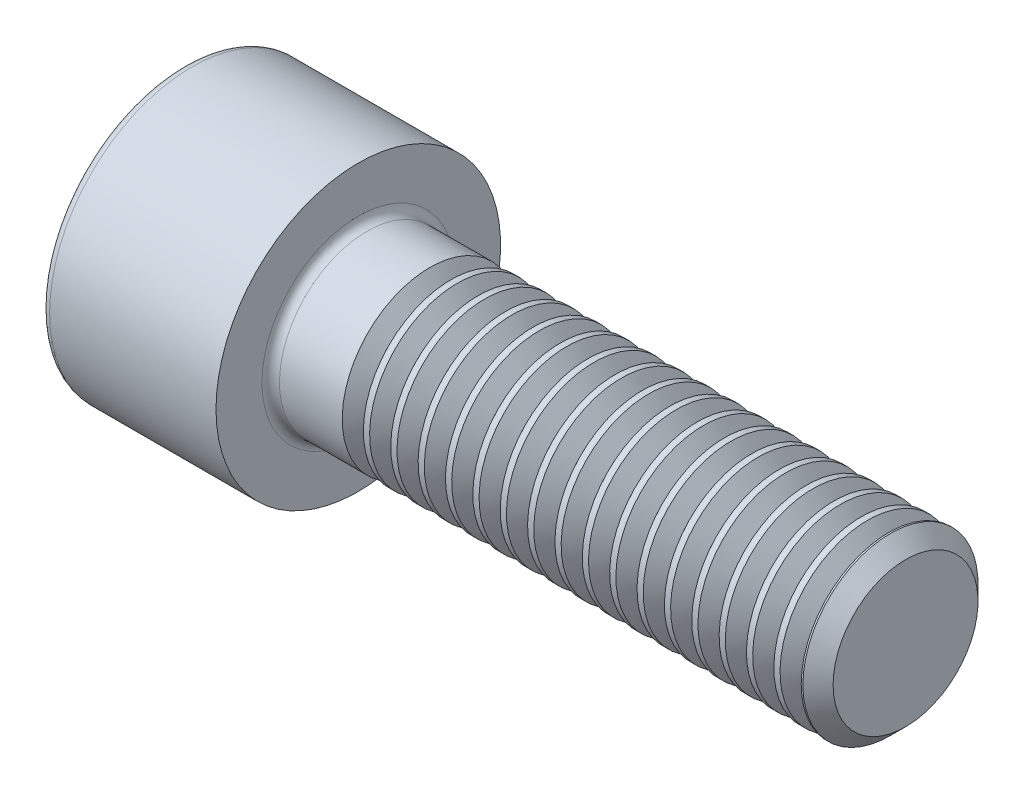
ISO-10303-21;
HEADER;
FILE_DESCRIPTION(('STEP AP214'),'2;1');
FILE_NAME('part.step','',(''),(''),'','','');
FILE_SCHEMA(('AUTOMOTIVE_DESIGN { 1 0 10303 214 1 1 1 1 }'));
ENDSEC;
DATA;
#1=APPLICATION_CONTEXT('core data for automotive mechanical design processes');
#2=APPLICATION_PROTOCOL_DEFINITION('international standard','automotive_design',2000,#1);
#3=PRODUCT_CONTEXT('',#1,'mechanical');
#4=PRODUCT('Part','Part','',(#3));
#5=PRODUCT_RELATED_PRODUCT_CATEGORY('part','',(#4));
#6=PRODUCT_DEFINITION_FORMATION('','',#4);
#7=PRODUCT_DEFINITION_CONTEXT('part definition',#1,'design');
#8=PRODUCT_DEFINITION('design','',#6,#7);
#9=PRODUCT_DEFINITION_SHAPE('','',#8);
#10=(LENGTH_UNIT() NAMED_UNIT(*) SI_UNIT(.MILLI.,.METRE.));
#11=(NAMED_UNIT(*) PLANE_ANGLE_UNIT() SI_UNIT($,.RADIAN.));
#12=(NAMED_UNIT(*) SI_UNIT($,.STERADIAN.) SOLID_ANGLE_UNIT());
#13=UNCERTAINTY_MEASURE_WITH_UNIT(LENGTH_MEASURE(1.E-05),#10,'distance_accuracy_value','');
#14=(GEOMETRIC_REPRESENTATION_CONTEXT(3) GLOBAL_UNCERTAINTY_ASSIGNED_CONTEXT((#13)) GLOBAL_UNIT_ASSIGNED_CONTEXT((#10,
#11,#12)) REPRESENTATION_CONTEXT('',''));
#15=CARTESIAN_POINT('',(0.,0.,0.));
#16=DIRECTION('',(0.,0.,1.));
#17=DIRECTION('',(1.,0.,0.));
#18=AXIS2_PLACEMENT_3D('',#15,#16,#17);
#19=CARTESIAN_POINT('',(0.,0.,0.));
#20=DIRECTION('',(-1.,0.,0.));
#21=DIRECTION('',(0.,0.,1.));
#22=AXIS2_PLACEMENT_3D('',#19,#20,#21);
#23=PLANE('',#22);
#24=DIRECTION('',(0.,-0.499999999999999,0.866025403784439));
#25=VECTOR('',#24,1.);
#26=CARTESIAN_POINT('',(0.,3.51894989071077,0.));
#27=LINE('',#26,#25);
#28=CARTESIAN_POINT('',(0.,3.51894989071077,0.));
#29=VERTEX_POINT('',#28);
#30=CARTESIAN_POINT('',(0.,1.75947494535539,3.04749999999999));
#31=VERTEX_POINT('',#30);
#32=EDGE_CURVE('E112',#29,#31,#27,.T.);
#33=ORIENTED_EDGE('',*,*,#32,.T.);
#34=DIRECTION('',(0.,1.,0.));
#35=VECTOR('',#34,1.);
#36=CARTESIAN_POINT('',(0.,-1.75947494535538,3.0475));
#37=LINE('',#36,#35);
#38=CARTESIAN_POINT('',(0.,-1.75947494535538,3.0475));
#39=VERTEX_POINT('',#38);
#40=EDGE_CURVE('E101',#39,#31,#37,.T.);
#41=ORIENTED_EDGE('',*,*,#40,.F.);
#42=DIRECTION('',(0.,-0.500000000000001,-0.866025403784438));
#43=VECTOR('',#42,1.);
#44=CARTESIAN_POINT('',(0.,-1.75947494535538,3.0475));
#45=LINE('',#44,#43);
#46=CARTESIAN_POINT('',(0.,-3.51894989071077,0.));
#47=VERTEX_POINT('',#46);
#48=EDGE_CURVE('E111',#39,#47,#45,.T.);
#49=ORIENTED_EDGE('',*,*,#48,.T.);
#50=DIRECTION('',(0.,0.499999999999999,-0.866025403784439));
#51=VECTOR('',#50,1.);
#52=CARTESIAN_POINT('',(0.,-3.51894989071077,0.));
#53=LINE('',#52,#51);
#54=CARTESIAN_POINT('',(0.,-1.75947494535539,-3.0475));
#55=VERTEX_POINT('',#54);
#56=EDGE_CURVE('E135',#47,#55,#53,.T.);
#57=ORIENTED_EDGE('',*,*,#56,.T.);
#58=DIRECTION('',(0.,-1.,0.));
#59=VECTOR('',#58,1.);
#60=CARTESIAN_POINT('',(0.,1.75947494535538,-3.04750000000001));
#61=LINE('',#60,#59);
#62=CARTESIAN_POINT('',(0.,1.75947494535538,-3.04750000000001));
#63=VERTEX_POINT('',#62);
#64=EDGE_CURVE('E138',#63,#55,#61,.T.);
#65=ORIENTED_EDGE('',*,*,#64,.F.);
#66=DIRECTION('',(0.,-0.500000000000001,-0.866025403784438));
#67=VECTOR('',#66,1.);
#68=CARTESIAN_POINT('',(0.,3.51894989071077,0.));
#69=LINE('',#68,#67);
#70=EDGE_CURVE('E126',#29,#63,#69,.T.);
#71=ORIENTED_EDGE('',*,*,#70,.F.);
#72=EDGE_LOOP('',(#33,#41,#49,#57,#65,#71));
#73=FACE_BOUND('',#72,.T.);
#74=CARTESIAN_POINT('',(0.,0.,0.));
#75=DIRECTION('',(-1.,0.,0.));
#76=DIRECTION('',(0.,0.,1.));
#77=AXIS2_PLACEMENT_3D('',#74,#75,#76);
#78=CIRCLE('',#77,6.1);
#79=CARTESIAN_POINT('',(0.,0.,6.1));
#80=VERTEX_POINT('',#79);
#81=EDGE_CURVE('E37',#80,#80,#78,.T.);
#82=ORIENTED_EDGE('',*,*,#81,.T.);
#83=EDGE_LOOP('',(#82));
#84=FACE_BOUND('',#83,.T.);
#85=ADVANCED_FACE('F29',(#73,#84),#23,.T.);
#86=CARTESIAN_POINT('',(-31.75,0.,0.));
#87=DIRECTION('',(-1.,0.,0.));
#88=DIRECTION('',(0.,0.,1.));
#89=AXIS2_PLACEMENT_3D('',#86,#87,#88);
#90=CYLINDRICAL_SURFACE('',#89,3.99999999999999);
#91=CARTESIAN_POINT('',(11.2665066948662,0.,0.));
#92=DIRECTION('',(-1.,0.,0.));
#93=DIRECTION('',(0.,-1.,0.));
#94=AXIS2_PLACEMENT_3D('',#91,#92,#93);
#95=CIRCLE('',#94,4.);
#96=CARTESIAN_POINT('',(11.2665066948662,-4.,0.));
#97=VERTEX_POINT('',#96);
#98=EDGE_CURVE('E130',#97,#97,#95,.T.);
#99=ORIENTED_EDGE('',*,*,#98,.T.);
#100=EDGE_LOOP('',(#99));
#101=FACE_BOUND('',#100,.T.);
#102=CARTESIAN_POINT('',(8.4,0.,0.));
#103=DIRECTION('',(1.,0.,0.));
#104=DIRECTION('',(0.,0.,-1.));
#105=AXIS2_PLACEMENT_3D('',#102,#103,#104);
#106=CIRCLE('',#105,3.99999999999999);
#107=CARTESIAN_POINT('',(8.4,0.,-3.99999999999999));
#108=VERTEX_POINT('',#107);
#109=EDGE_CURVE('E189',#108,#108,#106,.T.);
#110=ORIENTED_EDGE('',*,*,#109,.T.);
#111=EDGE_LOOP('',(#110));
#112=FACE_BOUND('',#111,.T.);
#113=ADVANCED_FACE('F211',(#101,#112),#90,.T.);
#114=CARTESIAN_POINT('',(8.,6.5,0.));
#115=DIRECTION('',(1.,0.,0.));
#116=DIRECTION('',(0.,0.,-1.));
#117=AXIS2_PLACEMENT_3D('',#114,#115,#116);
#118=PLANE('',#117);
#119=CARTESIAN_POINT('',(8.,0.,0.));
#120=DIRECTION('',(1.,0.,0.));
#121=DIRECTION('',(0.,0.,-1.));
#122=AXIS2_PLACEMENT_3D('',#119,#120,#121);
#123=CIRCLE('',#122,4.39999999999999);
#124=CARTESIAN_POINT('',(8.,0.,-4.39999999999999));
#125=VERTEX_POINT('',#124);
#126=EDGE_CURVE('E186',#125,#125,#123,.F.);
#127=ORIENTED_EDGE('',*,*,#126,.T.);
#128=EDGE_LOOP('',(#127));
#129=FACE_BOUND('',#128,.T.);
#130=CARTESIAN_POINT('',(8.00000000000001,0.,0.));
#131=DIRECTION('',(-1.,0.,0.));
#132=DIRECTION('',(0.,0.,1.));
#133=AXIS2_PLACEMENT_3D('',#130,#131,#132);
#134=CIRCLE('',#133,6.5);
#135=CARTESIAN_POINT('',(8.00000000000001,0.,6.5));
#136=VERTEX_POINT('',#135);
#137=EDGE_CURVE('E176',#136,#136,#134,.T.);
#138=ORIENTED_EDGE('',*,*,#137,.F.);
#139=EDGE_LOOP('',(#138));
#140=FACE_BOUND('',#139,.T.);
#141=ADVANCED_FACE('F216',(#129,#140),#118,.T.);
#142=CARTESIAN_POINT('',(-31.75,0.,0.));
#143=DIRECTION('',(-1.,0.,0.));
#144=DIRECTION('',(0.,0.,1.));
#145=AXIS2_PLACEMENT_3D('',#142,#143,#144);
#146=CYLINDRICAL_SURFACE('',#145,6.5);
#147=CARTESIAN_POINT('',(0.399999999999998,0.,0.));
#148=DIRECTION('',(-1.,0.,0.));
#149=DIRECTION('',(0.,0.,1.));
#150=AXIS2_PLACEMENT_3D('',#147,#148,#149);
#151=CIRCLE('',#150,6.5);
#152=CARTESIAN_POINT('',(0.399999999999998,0.,6.5));
#153=VERTEX_POINT('',#152);
#154=EDGE_CURVE('E11',#153,#153,#151,.F.);
#155=ORIENTED_EDGE('',*,*,#154,.T.);
#156=EDGE_LOOP('',(#155));
#157=FACE_BOUND('',#156,.T.);
#158=ORIENTED_EDGE('',*,*,#137,.T.);
#159=EDGE_LOOP('',(#158));
#160=FACE_BOUND('',#159,.T.);
#161=ADVANCED_FACE('F206',(#157,#160),#146,.T.);
#162=CARTESIAN_POINT('',(8.4,0.,0.));
#163=DIRECTION('',(1.,0.,0.));
#164=DIRECTION('',(0.,0.,-1.));
#165=AXIS2_PLACEMENT_3D('',#162,#163,#164);
#166=TOROIDAL_SURFACE('',#165,4.39999999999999,0.4);
#167=ORIENTED_EDGE('',*,*,#109,.F.);
#168=EDGE_LOOP('',(#167));
#169=FACE_BOUND('',#168,.T.);
#170=ORIENTED_EDGE('',*,*,#126,.F.);
#171=EDGE_LOOP('',(#170));
#172=FACE_BOUND('',#171,.T.);
#173=ADVANCED_FACE('F196',(#169,#172),#166,.F.);
#174=CARTESIAN_POINT('',(0.399999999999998,0.,0.));
#175=DIRECTION('',(-1.,0.,0.));
#176=DIRECTION('',(0.,0.,1.));
#177=AXIS2_PLACEMENT_3D('',#174,#175,#176);
#178=TOROIDAL_SURFACE('',#177,6.1,0.4);
#179=ORIENTED_EDGE('',*,*,#154,.F.);
#180=EDGE_LOOP('',(#179));
#181=FACE_BOUND('',#180,.T.);
#182=ORIENTED_EDGE('',*,*,#81,.F.);
#183=EDGE_LOOP('',(#182));
#184=FACE_BOUND('',#183,.T.);
#185=ADVANCED_FACE('F194',(#181,#184),#178,.T.);
#186=CARTESIAN_POINT('',(4.,3.51894989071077,0.));
#187=DIRECTION('',(0.,-0.866025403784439,-0.499999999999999));
#188=DIRECTION('',(0.,0.499999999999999,-0.866025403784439));
#189=AXIS2_PLACEMENT_3D('',#186,#187,#188);
#190=PLANE('',#189);
#191=ORIENTED_EDGE('',*,*,#32,.F.);
#192=DIRECTION('',(-1.,0.,0.));
#193=VECTOR('',#192,1.);
#194=CARTESIAN_POINT('',(4.,3.51894989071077,0.));
#195=LINE('',#194,#193);
#196=CARTESIAN_POINT('',(4.,3.51894989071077,0.));
#197=VERTEX_POINT('',#196);
#198=EDGE_CURVE('E161',#197,#29,#195,.T.);
#199=ORIENTED_EDGE('',*,*,#198,.F.);
#200=DIRECTION('',(0.,-0.499999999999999,0.866025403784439));
#201=VECTOR('',#200,1.);
#202=CARTESIAN_POINT('',(4.,3.51894989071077,0.));
#203=LINE('',#202,#201);
#204=CARTESIAN_POINT('',(4.,2.63921241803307,1.52374999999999));
#205=VERTEX_POINT('',#204);
#206=EDGE_CURVE('E141',#197,#205,#203,.T.);
#207=ORIENTED_EDGE('',*,*,#206,.T.);
#208=CARTESIAN_POINT('',(4.,1.75947494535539,3.04749999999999));
#209=VERTEX_POINT('',#208);
#210=EDGE_CURVE('E120',#205,#209,#203,.T.);
#211=ORIENTED_EDGE('',*,*,#210,.T.);
#212=DIRECTION('',(-1.,0.,0.));
#213=VECTOR('',#212,1.);
#214=CARTESIAN_POINT('',(4.,1.75947494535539,3.04749999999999));
#215=LINE('',#214,#213);
#216=EDGE_CURVE('E105',#209,#31,#215,.T.);
#217=ORIENTED_EDGE('',*,*,#216,.T.);
#218=EDGE_LOOP('',(#191,#199,#207,#211,#217));
#219=FACE_BOUND('',#218,.T.);
#220=ADVANCED_FACE('F116',(#219),#190,.T.);
#221=CARTESIAN_POINT('',(4.,-1.75947494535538,3.0475));
#222=DIRECTION('',(0.,0.,1.));
#223=DIRECTION('',(0.,-1.,0.));
#224=AXIS2_PLACEMENT_3D('',#221,#222,#223);
#225=PLANE('',#224);
#226=ORIENTED_EDGE('',*,*,#40,.T.);
#227=ORIENTED_EDGE('',*,*,#216,.F.);
#228=DIRECTION('',(0.,1.,0.));
#229=VECTOR('',#228,1.);
#230=CARTESIAN_POINT('',(4.,-1.75947494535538,3.0475));
#231=LINE('',#230,#229);
#232=CARTESIAN_POINT('',(4.,0.,3.0475));
#233=VERTEX_POINT('',#232);
#234=EDGE_CURVE('E143',#233,#209,#231,.T.);
#235=ORIENTED_EDGE('',*,*,#234,.F.);
#236=CARTESIAN_POINT('',(4.,-1.75947494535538,3.0475));
#237=VERTEX_POINT('',#236);
#238=EDGE_CURVE('E144',#237,#233,#231,.T.);
#239=ORIENTED_EDGE('',*,*,#238,.F.);
#240=DIRECTION('',(-1.,0.,0.));
#241=VECTOR('',#240,1.);
#242=CARTESIAN_POINT('',(4.,-1.75947494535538,3.0475));
#243=LINE('',#242,#241);
#244=EDGE_CURVE('E107',#237,#39,#243,.T.);
#245=ORIENTED_EDGE('',*,*,#244,.T.);
#246=EDGE_LOOP('',(#226,#227,#235,#239,#245));
#247=FACE_BOUND('',#246,.T.);
#248=ADVANCED_FACE('F103',(#247),#225,.F.);
#249=CARTESIAN_POINT('',(4.,-1.75947494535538,3.0475));
#250=DIRECTION('',(0.,0.866025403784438,-0.500000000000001));
#251=DIRECTION('',(0.,0.500000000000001,0.866025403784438));
#252=AXIS2_PLACEMENT_3D('',#249,#250,#251);
#253=PLANE('',#252);
#254=ORIENTED_EDGE('',*,*,#48,.F.);
#255=ORIENTED_EDGE('',*,*,#244,.F.);
#256=DIRECTION('',(0.,-0.500000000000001,-0.866025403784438));
#257=VECTOR('',#256,1.);
#258=CARTESIAN_POINT('',(4.,-1.75947494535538,3.0475));
#259=LINE('',#258,#257);
#260=CARTESIAN_POINT('',(4.,-2.63921241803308,1.52375));
#261=VERTEX_POINT('',#260);
#262=EDGE_CURVE('E148',#237,#261,#259,.T.);
#263=ORIENTED_EDGE('',*,*,#262,.T.);
#264=CARTESIAN_POINT('',(4.,-3.51894989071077,0.));
#265=VERTEX_POINT('',#264);
#266=EDGE_CURVE('E147',#261,#265,#259,.T.);
#267=ORIENTED_EDGE('',*,*,#266,.T.);
#268=DIRECTION('',(-1.,0.,0.));
#269=VECTOR('',#268,1.);
#270=CARTESIAN_POINT('',(4.,-3.51894989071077,0.));
#271=LINE('',#270,#269);
#272=EDGE_CURVE('E169',#265,#47,#271,.T.);
#273=ORIENTED_EDGE('',*,*,#272,.T.);
#274=EDGE_LOOP('',(#254,#255,#263,#267,#273));
#275=FACE_BOUND('',#274,.T.);
#276=ADVANCED_FACE('F415',(#275),#253,.T.);
#277=CARTESIAN_POINT('',(4.,-3.51894989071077,0.));
#278=DIRECTION('',(0.,0.866025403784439,0.499999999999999));
#279=DIRECTION('',(0.,-0.499999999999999,0.866025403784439));
#280=AXIS2_PLACEMENT_3D('',#277,#278,#279);
#281=PLANE('',#280);
#282=ORIENTED_EDGE('',*,*,#56,.F.);
#283=ORIENTED_EDGE('',*,*,#272,.F.);
#284=DIRECTION('',(0.,0.499999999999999,-0.866025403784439));
#285=VECTOR('',#284,1.);
#286=CARTESIAN_POINT('',(4.,-3.51894989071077,0.));
#287=LINE('',#286,#285);
#288=CARTESIAN_POINT('',(4.,-2.63921241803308,-1.52375));
#289=VERTEX_POINT('',#288);
#290=EDGE_CURVE('E152',#265,#289,#287,.T.);
#291=ORIENTED_EDGE('',*,*,#290,.T.);
#292=CARTESIAN_POINT('',(4.,-1.75947494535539,-3.0475));
#293=VERTEX_POINT('',#292);
#294=EDGE_CURVE('E151',#289,#293,#287,.T.);
#295=ORIENTED_EDGE('',*,*,#294,.T.);
#296=DIRECTION('',(-1.,0.,0.));
#297=VECTOR('',#296,1.);
#298=CARTESIAN_POINT('',(4.,-1.75947494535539,-3.0475));
#299=LINE('',#298,#297);
#300=EDGE_CURVE('E166',#293,#55,#299,.T.);
#301=ORIENTED_EDGE('',*,*,#300,.T.);
#302=EDGE_LOOP('',(#282,#283,#291,#295,#301));
#303=FACE_BOUND('',#302,.T.);
#304=ADVANCED_FACE('F411',(#303),#281,.T.);
#305=CARTESIAN_POINT('',(4.,1.75947494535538,-3.04750000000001));
#306=DIRECTION('',(0.,0.,-1.));
#307=DIRECTION('',(0.,1.,0.));
#308=AXIS2_PLACEMENT_3D('',#305,#306,#307);
#309=PLANE('',#308);
#310=ORIENTED_EDGE('',*,*,#64,.T.);
#311=ORIENTED_EDGE('',*,*,#300,.F.);
#312=DIRECTION('',(0.,-1.,0.));
#313=VECTOR('',#312,1.);
#314=CARTESIAN_POINT('',(4.,1.75947494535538,-3.04750000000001));
#315=LINE('',#314,#313);
#316=CARTESIAN_POINT('',(4.,0.,-3.0475));
#317=VERTEX_POINT('',#316);
#318=EDGE_CURVE('E155',#317,#293,#315,.T.);
#319=ORIENTED_EDGE('',*,*,#318,.F.);
#320=CARTESIAN_POINT('',(4.,1.75947494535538,-3.04750000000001));
#321=VERTEX_POINT('',#320);
#322=EDGE_CURVE('E44',#321,#317,#315,.T.);
#323=ORIENTED_EDGE('',*,*,#322,.F.);
#324=DIRECTION('',(-1.,0.,0.));
#325=VECTOR('',#324,1.);
#326=CARTESIAN_POINT('',(4.,1.75947494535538,-3.04750000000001));
#327=LINE('',#326,#325);
#328=EDGE_CURVE('E163',#321,#63,#327,.T.);
#329=ORIENTED_EDGE('',*,*,#328,.T.);
#330=EDGE_LOOP('',(#310,#311,#319,#323,#329));
#331=FACE_BOUND('',#330,.T.);
#332=ADVANCED_FACE('F407',(#331),#309,.F.);
#333=CARTESIAN_POINT('',(4.,3.51894989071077,0.));
#334=DIRECTION('',(0.,0.866025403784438,-0.500000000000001));
#335=DIRECTION('',(0.,0.500000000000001,0.866025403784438));
#336=AXIS2_PLACEMENT_3D('',#333,#334,#335);
#337=PLANE('',#336);
#338=ORIENTED_EDGE('',*,*,#70,.T.);
#339=ORIENTED_EDGE('',*,*,#328,.F.);
#340=DIRECTION('',(0.,-0.500000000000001,-0.866025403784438));
#341=VECTOR('',#340,1.);
#342=CARTESIAN_POINT('',(4.,3.51894989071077,0.));
#343=LINE('',#342,#341);
#344=CARTESIAN_POINT('',(4.,2.63921241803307,-1.52375));
#345=VERTEX_POINT('',#344);
#346=EDGE_CURVE('E157',#345,#321,#343,.T.);
#347=ORIENTED_EDGE('',*,*,#346,.F.);
#348=EDGE_CURVE('E158',#197,#345,#343,.T.);
#349=ORIENTED_EDGE('',*,*,#348,.F.);
#350=ORIENTED_EDGE('',*,*,#198,.T.);
#351=EDGE_LOOP('',(#338,#339,#347,#349,#350));
#352=FACE_BOUND('',#351,.T.);
#353=ADVANCED_FACE('F402',(#352),#337,.F.);
#354=CARTESIAN_POINT('',(4.,5.27842483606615,-3.04750000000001));
#355=DIRECTION('',(1.,0.,0.));
#356=DIRECTION('',(0.,0.,-1.));
#357=AXIS2_PLACEMENT_3D('',#354,#355,#356);
#358=PLANE('',#357);
#359=ORIENTED_EDGE('',*,*,#318,.T.);
#360=ORIENTED_EDGE('',*,*,#294,.F.);
#361=CARTESIAN_POINT('',(4.,0.,0.));
#362=DIRECTION('',(-1.,0.,0.));
#363=DIRECTION('',(0.,0.,1.));
#364=AXIS2_PLACEMENT_3D('',#361,#362,#363);
#365=CIRCLE('',#364,3.0475);
#366=EDGE_CURVE('E441',#317,#289,#365,.T.);
#367=ORIENTED_EDGE('',*,*,#366,.F.);
#368=EDGE_LOOP('',(#359,#360,#367));
#369=FACE_BOUND('',#368,.T.);
#370=ADVANCED_FACE('F398',(#369),#358,.F.);
#371=ORIENTED_EDGE('',*,*,#290,.F.);
#372=ORIENTED_EDGE('',*,*,#266,.F.);
#373=EDGE_CURVE('E439',#289,#261,#365,.T.);
#374=ORIENTED_EDGE('',*,*,#373,.F.);
#375=EDGE_LOOP('',(#371,#372,#374));
#376=FACE_BOUND('',#375,.T.);
#377=ADVANCED_FACE('F401',(#376),#358,.F.);
#378=ORIENTED_EDGE('',*,*,#262,.F.);
#379=ORIENTED_EDGE('',*,*,#238,.T.);
#380=EDGE_CURVE('E121',#261,#233,#365,.T.);
#381=ORIENTED_EDGE('',*,*,#380,.F.);
#382=EDGE_LOOP('',(#378,#379,#381));
#383=FACE_BOUND('',#382,.T.);
#384=ADVANCED_FACE('F435',(#383),#358,.F.);
#385=ORIENTED_EDGE('',*,*,#234,.T.);
#386=ORIENTED_EDGE('',*,*,#210,.F.);
#387=EDGE_CURVE('E173',#233,#205,#365,.T.);
#388=ORIENTED_EDGE('',*,*,#387,.F.);
#389=EDGE_LOOP('',(#385,#386,#388));
#390=FACE_BOUND('',#389,.T.);
#391=ADVANCED_FACE('F432',(#390),#358,.F.);
#392=ORIENTED_EDGE('',*,*,#206,.F.);
#393=ORIENTED_EDGE('',*,*,#348,.T.);
#394=EDGE_CURVE('E177',#205,#345,#365,.T.);
#395=ORIENTED_EDGE('',*,*,#394,.F.);
#396=EDGE_LOOP('',(#392,#393,#395));
#397=FACE_BOUND('',#396,.T.);
#398=ADVANCED_FACE('F425',(#397),#358,.F.);
#399=ORIENTED_EDGE('',*,*,#346,.T.);
#400=ORIENTED_EDGE('',*,*,#322,.T.);
#401=EDGE_CURVE('E445',#345,#317,#365,.T.);
#402=ORIENTED_EDGE('',*,*,#401,.F.);
#403=EDGE_LOOP('',(#399,#400,#402));
#404=FACE_BOUND('',#403,.T.);
#405=ADVANCED_FACE('F404',(#404),#358,.F.);
#406=CARTESIAN_POINT('',(4.,0.,0.));
#407=DIRECTION('',(-1.,0.,0.));
#408=DIRECTION('',(0.,0.,1.));
#409=AXIS2_PLACEMENT_3D('',#406,#407,#408);
#410=CONICAL_SURFACE('',#409,3.0475,1.04719755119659);
#411=CARTESIAN_POINT('',(5.75947494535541,0.,0.));
#412=VERTEX_POINT('',#411);
#413=VERTEX_LOOP('',#412);
#414=FACE_BOUND('',#413,.T.);
#415=ORIENTED_EDGE('',*,*,#387,.T.);
#416=ORIENTED_EDGE('',*,*,#394,.T.);
#417=ORIENTED_EDGE('',*,*,#401,.T.);
#418=ORIENTED_EDGE('',*,*,#366,.T.);
#419=ORIENTED_EDGE('',*,*,#373,.T.);
#420=ORIENTED_EDGE('',*,*,#380,.T.);
#421=EDGE_LOOP('',(#415,#416,#417,#418,#419,#420));
#422=FACE_BOUND('',#421,.T.);
#423=ADVANCED_FACE('F396',(#414,#422),#410,.F.);
#424=CARTESIAN_POINT('',(12.2334933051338,0.,0.));
#425=DIRECTION('',(1.,0.,0.));
#426=DIRECTION('',(0.,1.,0.));
#427=AXIS2_PLACEMENT_3D('',#424,#425,#426);
#428=CONICAL_SURFACE('',#427,4.,0.959931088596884);
#429=CARTESIAN_POINT('',(11.75,0.,0.));
#430=DIRECTION('',(-1.,0.,0.));
#431=DIRECTION('',(0.,-1.,0.));
#432=AXIS2_PLACEMENT_3D('',#429,#430,#431);
#433=CIRCLE('',#432,3.3095);
#434=CARTESIAN_POINT('',(11.75,-3.3095,0.));
#435=VERTEX_POINT('',#434);
#436=EDGE_CURVE('E845',#435,#435,#433,.T.);
#437=ORIENTED_EDGE('',*,*,#436,.F.);
#438=EDGE_LOOP('',(#437));
#439=FACE_BOUND('',#438,.T.);
#440=CARTESIAN_POINT('',(12.2334933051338,0.,0.));
#441=DIRECTION('',(-1.,0.,0.));
#442=DIRECTION('',(0.,-1.,0.));
#443=AXIS2_PLACEMENT_3D('',#440,#441,#442);
#444=CIRCLE('',#443,4.);
#445=CARTESIAN_POINT('',(12.2334933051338,-4.,0.));
#446=VERTEX_POINT('',#445);
#447=EDGE_CURVE('E127',#446,#446,#444,.T.);
#448=ORIENTED_EDGE('',*,*,#447,.T.);
#449=EDGE_LOOP('',(#448));
#450=FACE_BOUND('',#449,.T.);
#451=ADVANCED_FACE('F392',(#439,#450),#428,.T.);
#452=CARTESIAN_POINT('',(11.75,0.,0.));
#453=DIRECTION('',(-1.,0.,0.));
#454=DIRECTION('',(0.,-1.,0.));
#455=AXIS2_PLACEMENT_3D('',#452,#453,#454);
#456=CONICAL_SURFACE('',#455,3.3095,0.959931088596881);
#457=ORIENTED_EDGE('',*,*,#98,.F.);
#458=EDGE_LOOP('',(#457));
#459=FACE_BOUND('',#458,.T.);
#460=ORIENTED_EDGE('',*,*,#436,.T.);
#461=EDGE_LOOP('',(#460));
#462=FACE_BOUND('',#461,.T.);
#463=ADVANCED_FACE('F389',(#459,#462),#456,.T.);
#464=CARTESIAN_POINT('',(12.5165066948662,0.,0.));
#465=DIRECTION('',(-1.,0.,0.));
#466=DIRECTION('',(0.,-1.,0.));
#467=AXIS2_PLACEMENT_3D('',#464,#465,#466);
#468=CIRCLE('',#467,4.);
#469=CARTESIAN_POINT('',(12.5165066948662,-4.,0.));
#470=VERTEX_POINT('',#469);
#471=EDGE_CURVE('E839',#470,#470,#468,.T.);
#472=ORIENTED_EDGE('',*,*,#471,.T.);
#473=EDGE_LOOP('',(#472));
#474=FACE_BOUND('',#473,.T.);
#475=ORIENTED_EDGE('',*,*,#447,.F.);
#476=EDGE_LOOP('',(#475));
#477=FACE_BOUND('',#476,.T.);
#478=ADVANCED_FACE('F220',(#474,#477),#90,.T.);
#479=CARTESIAN_POINT('',(13.4834933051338,0.,0.));
#480=DIRECTION('',(1.,0.,0.));
#481=DIRECTION('',(0.,1.,0.));
#482=AXIS2_PLACEMENT_3D('',#479,#480,#481);
#483=CONICAL_SURFACE('',#482,4.,0.959931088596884);
#484=CARTESIAN_POINT('',(13.,0.,0.));
#485=DIRECTION('',(-1.,0.,0.));
#486=DIRECTION('',(0.,-1.,0.));
#487=AXIS2_PLACEMENT_3D('',#484,#485,#486);
#488=CIRCLE('',#487,3.3095);
#489=CARTESIAN_POINT('',(13.,-3.3095,0.));
#490=VERTEX_POINT('',#489);
#491=EDGE_CURVE('E836',#490,#490,#488,.T.);
#492=ORIENTED_EDGE('',*,*,#491,.F.);
#493=EDGE_LOOP('',(#492));
#494=FACE_BOUND('',#493,.T.);
#495=CARTESIAN_POINT('',(13.4834933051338,0.,0.));
#496=DIRECTION('',(-1.,0.,0.));
#497=DIRECTION('',(0.,-1.,0.));
#498=AXIS2_PLACEMENT_3D('',#495,#496,#497);
#499=CIRCLE('',#498,4.);
#500=CARTESIAN_POINT('',(13.4834933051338,-4.,0.));
#501=VERTEX_POINT('',#500);
#502=EDGE_CURVE('E842',#501,#501,#499,.T.);
#503=ORIENTED_EDGE('',*,*,#502,.T.);
#504=EDGE_LOOP('',(#503));
#505=FACE_BOUND('',#504,.T.);
#506=ADVANCED_FACE('F384',(#494,#505),#483,.T.);
#507=CARTESIAN_POINT('',(13.,0.,0.));
#508=DIRECTION('',(-1.,0.,0.));
#509=DIRECTION('',(0.,-1.,0.));
#510=AXIS2_PLACEMENT_3D('',#507,#508,#509);
#511=CONICAL_SURFACE('',#510,3.3095,0.959931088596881);
#512=ORIENTED_EDGE('',*,*,#471,.F.);
#513=EDGE_LOOP('',(#512));
#514=FACE_BOUND('',#513,.T.);
#515=ORIENTED_EDGE('',*,*,#491,.T.);
#516=EDGE_LOOP('',(#515));
#517=FACE_BOUND('',#516,.T.);
#518=ADVANCED_FACE('F381',(#514,#517),#511,.T.);
#519=CARTESIAN_POINT('',(13.7665066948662,0.,0.));
#520=DIRECTION('',(-1.,0.,0.));
#521=DIRECTION('',(0.,-1.,0.));
#522=AXIS2_PLACEMENT_3D('',#519,#520,#521);
#523=CIRCLE('',#522,4.);
#524=CARTESIAN_POINT('',(13.7665066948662,-4.,0.));
#525=VERTEX_POINT('',#524);
#526=EDGE_CURVE('E830',#525,#525,#523,.T.);
#527=ORIENTED_EDGE('',*,*,#526,.T.);
#528=EDGE_LOOP('',(#527));
#529=FACE_BOUND('',#528,.T.);
#530=ORIENTED_EDGE('',*,*,#502,.F.);
#531=EDGE_LOOP('',(#530));
#532=FACE_BOUND('',#531,.T.);
#533=ADVANCED_FACE('F379',(#529,#532),#90,.T.);
#534=CARTESIAN_POINT('',(14.7334933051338,0.,0.));
#535=DIRECTION('',(1.,0.,0.));
#536=DIRECTION('',(0.,1.,0.));
#537=AXIS2_PLACEMENT_3D('',#534,#535,#536);
#538=CONICAL_SURFACE('',#537,4.,0.959931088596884);
#539=CARTESIAN_POINT('',(14.25,0.,0.));
#540=DIRECTION('',(-1.,0.,0.));
#541=DIRECTION('',(0.,-1.,0.));
#542=AXIS2_PLACEMENT_3D('',#539,#540,#541);
#543=CIRCLE('',#542,3.3095);
#544=CARTESIAN_POINT('',(14.25,-3.3095,0.));
#545=VERTEX_POINT('',#544);
#546=EDGE_CURVE('E827',#545,#545,#543,.T.);
#547=ORIENTED_EDGE('',*,*,#546,.F.);
#548=EDGE_LOOP('',(#547));
#549=FACE_BOUND('',#548,.T.);
#550=CARTESIAN_POINT('',(14.7334933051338,0.,0.));
#551=DIRECTION('',(-1.,0.,0.));
#552=DIRECTION('',(0.,-1.,0.));
#553=AXIS2_PLACEMENT_3D('',#550,#551,#552);
#554=CIRCLE('',#553,4.);
#555=CARTESIAN_POINT('',(14.7334933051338,-4.,0.));
#556=VERTEX_POINT('',#555);
#557=EDGE_CURVE('E833',#556,#556,#554,.T.);
#558=ORIENTED_EDGE('',*,*,#557,.T.);
#559=EDGE_LOOP('',(#558));
#560=FACE_BOUND('',#559,.T.);
#561=ADVANCED_FACE('F375',(#549,#560),#538,.T.);
#562=CARTESIAN_POINT('',(14.25,0.,0.));
#563=DIRECTION('',(-1.,0.,0.));
#564=DIRECTION('',(0.,-1.,0.));
#565=AXIS2_PLACEMENT_3D('',#562,#563,#564);
#566=CONICAL_SURFACE('',#565,3.3095,0.959931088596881);
#567=ORIENTED_EDGE('',*,*,#526,.F.);
#568=EDGE_LOOP('',(#567));
#569=FACE_BOUND('',#568,.T.);
#570=ORIENTED_EDGE('',*,*,#546,.T.);
#571=EDGE_LOOP('',(#570));
#572=FACE_BOUND('',#571,.T.);
#573=ADVANCED_FACE('F372',(#569,#572),#566,.T.);
#574=CARTESIAN_POINT('',(15.0165066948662,0.,0.));
#575=DIRECTION('',(-1.,0.,0.));
#576=DIRECTION('',(0.,-1.,0.));
#577=AXIS2_PLACEMENT_3D('',#574,#575,#576);
#578=CIRCLE('',#577,4.);
#579=CARTESIAN_POINT('',(15.0165066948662,-4.,0.));
#580=VERTEX_POINT('',#579);
#581=EDGE_CURVE('E821',#580,#580,#578,.T.);
#582=ORIENTED_EDGE('',*,*,#581,.T.);
#583=EDGE_LOOP('',(#582));
#584=FACE_BOUND('',#583,.T.);
#585=ORIENTED_EDGE('',*,*,#557,.F.);
#586=EDGE_LOOP('',(#585));
#587=FACE_BOUND('',#586,.T.);
#588=ADVANCED_FACE('F370',(#584,#587),#90,.T.);
#589=CARTESIAN_POINT('',(15.9834933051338,0.,0.));
#590=DIRECTION('',(1.,0.,0.));
#591=DIRECTION('',(0.,1.,0.));
#592=AXIS2_PLACEMENT_3D('',#589,#590,#591);
#593=CONICAL_SURFACE('',#592,4.,0.959931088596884);
#594=CARTESIAN_POINT('',(15.5,0.,0.));
#595=DIRECTION('',(-1.,0.,0.));
#596=DIRECTION('',(0.,-1.,0.));
#597=AXIS2_PLACEMENT_3D('',#594,#595,#596);
#598=CIRCLE('',#597,3.3095);
#599=CARTESIAN_POINT('',(15.5,-3.3095,0.));
#600=VERTEX_POINT('',#599);
#601=EDGE_CURVE('E818',#600,#600,#598,.T.);
#602=ORIENTED_EDGE('',*,*,#601,.F.);
#603=EDGE_LOOP('',(#602));
#604=FACE_BOUND('',#603,.T.);
#605=CARTESIAN_POINT('',(15.9834933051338,0.,0.));
#606=DIRECTION('',(-1.,0.,0.));
#607=DIRECTION('',(0.,-1.,0.));
#608=AXIS2_PLACEMENT_3D('',#605,#606,#607);
#609=CIRCLE('',#608,4.);
#610=CARTESIAN_POINT('',(15.9834933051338,-4.,0.));
#611=VERTEX_POINT('',#610);
#612=EDGE_CURVE('E824',#611,#611,#609,.T.);
#613=ORIENTED_EDGE('',*,*,#612,.T.);
#614=EDGE_LOOP('',(#613));
#615=FACE_BOUND('',#614,.T.);
#616=ADVANCED_FACE('F366',(#604,#615),#593,.T.);
#617=CARTESIAN_POINT('',(15.5,0.,0.));
#618=DIRECTION('',(-1.,0.,0.));
#619=DIRECTION('',(0.,-1.,0.));
#620=AXIS2_PLACEMENT_3D('',#617,#618,#619);
#621=CONICAL_SURFACE('',#620,3.3095,0.959931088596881);
#622=ORIENTED_EDGE('',*,*,#581,.F.);
#623=EDGE_LOOP('',(#622));
#624=FACE_BOUND('',#623,.T.);
#625=ORIENTED_EDGE('',*,*,#601,.T.);
#626=EDGE_LOOP('',(#625));
#627=FACE_BOUND('',#626,.T.);
#628=ADVANCED_FACE('F363',(#624,#627),#621,.T.);
#629=CARTESIAN_POINT('',(16.2665066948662,0.,0.));
#630=DIRECTION('',(-1.,0.,0.));
#631=DIRECTION('',(0.,-1.,0.));
#632=AXIS2_PLACEMENT_3D('',#629,#630,#631);
#633=CIRCLE('',#632,4.);
#634=CARTESIAN_POINT('',(16.2665066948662,-4.,0.));
#635=VERTEX_POINT('',#634);
#636=EDGE_CURVE('E812',#635,#635,#633,.T.);
#637=ORIENTED_EDGE('',*,*,#636,.T.);
#638=EDGE_LOOP('',(#637));
#639=FACE_BOUND('',#638,.T.);
#640=ORIENTED_EDGE('',*,*,#612,.F.);
#641=EDGE_LOOP('',(#640));
#642=FACE_BOUND('',#641,.T.);
#643=ADVANCED_FACE('F361',(#639,#642),#90,.T.);
#644=CARTESIAN_POINT('',(17.2334933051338,0.,0.));
#645=DIRECTION('',(1.,0.,0.));
#646=DIRECTION('',(0.,1.,0.));
#647=AXIS2_PLACEMENT_3D('',#644,#645,#646);
#648=CONICAL_SURFACE('',#647,4.,0.959931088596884);
#649=CARTESIAN_POINT('',(16.75,0.,0.));
#650=DIRECTION('',(-1.,0.,0.));
#651=DIRECTION('',(0.,-1.,0.));
#652=AXIS2_PLACEMENT_3D('',#649,#650,#651);
#653=CIRCLE('',#652,3.3095);
#654=CARTESIAN_POINT('',(16.75,-3.3095,0.));
#655=VERTEX_POINT('',#654);
#656=EDGE_CURVE('E809',#655,#655,#653,.T.);
#657=ORIENTED_EDGE('',*,*,#656,.F.);
#658=EDGE_LOOP('',(#657));
#659=FACE_BOUND('',#658,.T.);
#660=CARTESIAN_POINT('',(17.2334933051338,0.,0.));
#661=DIRECTION('',(-1.,0.,0.));
#662=DIRECTION('',(0.,-1.,0.));
#663=AXIS2_PLACEMENT_3D('',#660,#661,#662);
#664=CIRCLE('',#663,4.);
#665=CARTESIAN_POINT('',(17.2334933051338,-4.,0.));
#666=VERTEX_POINT('',#665);
#667=EDGE_CURVE('E815',#666,#666,#664,.T.);
#668=ORIENTED_EDGE('',*,*,#667,.T.);
#669=EDGE_LOOP('',(#668));
#670=FACE_BOUND('',#669,.T.);
#671=ADVANCED_FACE('F357',(#659,#670),#648,.T.);
#672=CARTESIAN_POINT('',(16.75,0.,0.));
#673=DIRECTION('',(-1.,0.,0.));
#674=DIRECTION('',(0.,-1.,0.));
#675=AXIS2_PLACEMENT_3D('',#672,#673,#674);
#676=CONICAL_SURFACE('',#675,3.3095,0.959931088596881);
#677=ORIENTED_EDGE('',*,*,#636,.F.);
#678=EDGE_LOOP('',(#677));
#679=FACE_BOUND('',#678,.T.);
#680=ORIENTED_EDGE('',*,*,#656,.T.);
#681=EDGE_LOOP('',(#680));
#682=FACE_BOUND('',#681,.T.);
#683=ADVANCED_FACE('F354',(#679,#682),#676,.T.);
#684=CARTESIAN_POINT('',(17.5165066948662,0.,0.));
#685=DIRECTION('',(-1.,0.,0.));
#686=DIRECTION('',(0.,-1.,0.));
#687=AXIS2_PLACEMENT_3D('',#684,#685,#686);
#688=CIRCLE('',#687,4.);
#689=CARTESIAN_POINT('',(17.5165066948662,-4.,0.));
#690=VERTEX_POINT('',#689);
#691=EDGE_CURVE('E803',#690,#690,#688,.T.);
#692=ORIENTED_EDGE('',*,*,#691,.T.);
#693=EDGE_LOOP('',(#692));
#694=FACE_BOUND('',#693,.T.);
#695=ORIENTED_EDGE('',*,*,#667,.F.);
#696=EDGE_LOOP('',(#695));
#697=FACE_BOUND('',#696,.T.);
#698=ADVANCED_FACE('F352',(#694,#697),#90,.T.);
#699=CARTESIAN_POINT('',(18.4834933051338,0.,0.));
#700=DIRECTION('',(1.,0.,0.));
#701=DIRECTION('',(0.,1.,0.));
#702=AXIS2_PLACEMENT_3D('',#699,#700,#701);
#703=CONICAL_SURFACE('',#702,4.,0.959931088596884);
#704=CARTESIAN_POINT('',(18.,0.,0.));
#705=DIRECTION('',(-1.,0.,0.));
#706=DIRECTION('',(0.,-1.,0.));
#707=AXIS2_PLACEMENT_3D('',#704,#705,#706);
#708=CIRCLE('',#707,3.3095);
#709=CARTESIAN_POINT('',(18.,-3.3095,0.));
#710=VERTEX_POINT('',#709);
#711=EDGE_CURVE('E800',#710,#710,#708,.T.);
#712=ORIENTED_EDGE('',*,*,#711,.F.);
#713=EDGE_LOOP('',(#712));
#714=FACE_BOUND('',#713,.T.);
#715=CARTESIAN_POINT('',(18.4834933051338,0.,0.));
#716=DIRECTION('',(-1.,0.,0.));
#717=DIRECTION('',(0.,-1.,0.));
#718=AXIS2_PLACEMENT_3D('',#715,#716,#717);
#719=CIRCLE('',#718,4.);
#720=CARTESIAN_POINT('',(18.4834933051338,-4.,0.));
#721=VERTEX_POINT('',#720);
#722=EDGE_CURVE('E806',#721,#721,#719,.T.);
#723=ORIENTED_EDGE('',*,*,#722,.T.);
#724=EDGE_LOOP('',(#723));
#725=FACE_BOUND('',#724,.T.);
#726=ADVANCED_FACE('F348',(#714,#725),#703,.T.);
#727=CARTESIAN_POINT('',(18.,0.,0.));
#728=DIRECTION('',(-1.,0.,0.));
#729=DIRECTION('',(0.,-1.,0.));
#730=AXIS2_PLACEMENT_3D('',#727,#728,#729);
#731=CONICAL_SURFACE('',#730,3.3095,0.959931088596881);
#732=ORIENTED_EDGE('',*,*,#691,.F.);
#733=EDGE_LOOP('',(#732));
#734=FACE_BOUND('',#733,.T.);
#735=ORIENTED_EDGE('',*,*,#711,.T.);
#736=EDGE_LOOP('',(#735));
#737=FACE_BOUND('',#736,.T.);
#738=ADVANCED_FACE('F345',(#734,#737),#731,.T.);
#739=CARTESIAN_POINT('',(18.7665066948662,0.,0.));
#740=DIRECTION('',(-1.,0.,0.));
#741=DIRECTION('',(0.,-1.,0.));
#742=AXIS2_PLACEMENT_3D('',#739,#740,#741);
#743=CIRCLE('',#742,4.);
#744=CARTESIAN_POINT('',(18.7665066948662,-4.,0.));
#745=VERTEX_POINT('',#744);
#746=EDGE_CURVE('E794',#745,#745,#743,.T.);
#747=ORIENTED_EDGE('',*,*,#746,.T.);
#748=EDGE_LOOP('',(#747));
#749=FACE_BOUND('',#748,.T.);
#750=ORIENTED_EDGE('',*,*,#722,.F.);
#751=EDGE_LOOP('',(#750));
#752=FACE_BOUND('',#751,.T.);
#753=ADVANCED_FACE('F343',(#749,#752),#90,.T.);
#754=CARTESIAN_POINT('',(19.7334933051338,0.,0.));
#755=DIRECTION('',(1.,0.,0.));
#756=DIRECTION('',(0.,1.,0.));
#757=AXIS2_PLACEMENT_3D('',#754,#755,#756);
#758=CONICAL_SURFACE('',#757,4.,0.959931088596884);
#759=CARTESIAN_POINT('',(19.25,0.,0.));
#760=DIRECTION('',(-1.,0.,0.));
#761=DIRECTION('',(0.,-1.,0.));
#762=AXIS2_PLACEMENT_3D('',#759,#760,#761);
#763=CIRCLE('',#762,3.3095);
#764=CARTESIAN_POINT('',(19.25,-3.3095,0.));
#765=VERTEX_POINT('',#764);
#766=EDGE_CURVE('E791',#765,#765,#763,.T.);
#767=ORIENTED_EDGE('',*,*,#766,.F.);
#768=EDGE_LOOP('',(#767));
#769=FACE_BOUND('',#768,.T.);
#770=CARTESIAN_POINT('',(19.7334933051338,0.,0.));
#771=DIRECTION('',(-1.,0.,0.));
#772=DIRECTION('',(0.,-1.,0.));
#773=AXIS2_PLACEMENT_3D('',#770,#771,#772);
#774=CIRCLE('',#773,4.);
#775=CARTESIAN_POINT('',(19.7334933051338,-4.,0.));
#776=VERTEX_POINT('',#775);
#777=EDGE_CURVE('E797',#776,#776,#774,.T.);
#778=ORIENTED_EDGE('',*,*,#777,.T.);
#779=EDGE_LOOP('',(#778));
#780=FACE_BOUND('',#779,.T.);
#781=ADVANCED_FACE('F339',(#769,#780),#758,.T.);
#782=CARTESIAN_POINT('',(19.25,0.,0.));
#783=DIRECTION('',(-1.,0.,0.));
#784=DIRECTION('',(0.,-1.,0.));
#785=AXIS2_PLACEMENT_3D('',#782,#783,#784);
#786=CONICAL_SURFACE('',#785,3.3095,0.959931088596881);
#787=ORIENTED_EDGE('',*,*,#746,.F.);
#788=EDGE_LOOP('',(#787));
#789=FACE_BOUND('',#788,.T.);
#790=ORIENTED_EDGE('',*,*,#766,.T.);
#791=EDGE_LOOP('',(#790));
#792=FACE_BOUND('',#791,.T.);
#793=ADVANCED_FACE('F336',(#789,#792),#786,.T.);
#794=CARTESIAN_POINT('',(20.0165066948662,0.,0.));
#795=DIRECTION('',(-1.,0.,0.));
#796=DIRECTION('',(0.,-1.,0.));
#797=AXIS2_PLACEMENT_3D('',#794,#795,#796);
#798=CIRCLE('',#797,4.);
#799=CARTESIAN_POINT('',(20.0165066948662,-4.,0.));
#800=VERTEX_POINT('',#799);
#801=EDGE_CURVE('E785',#800,#800,#798,.T.);
#802=ORIENTED_EDGE('',*,*,#801,.T.);
#803=EDGE_LOOP('',(#802));
#804=FACE_BOUND('',#803,.T.);
#805=ORIENTED_EDGE('',*,*,#777,.F.);
#806=EDGE_LOOP('',(#805));
#807=FACE_BOUND('',#806,.T.);
#808=ADVANCED_FACE('F334',(#804,#807),#90,.T.);
#809=CARTESIAN_POINT('',(20.9834933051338,0.,0.));
#810=DIRECTION('',(1.,0.,0.));
#811=DIRECTION('',(0.,1.,0.));
#812=AXIS2_PLACEMENT_3D('',#809,#810,#811);
#813=CONICAL_SURFACE('',#812,4.,0.959931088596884);
#814=CARTESIAN_POINT('',(20.5,0.,0.));
#815=DIRECTION('',(-1.,0.,0.));
#816=DIRECTION('',(0.,-1.,0.));
#817=AXIS2_PLACEMENT_3D('',#814,#815,#816);
#818=CIRCLE('',#817,3.3095);
#819=CARTESIAN_POINT('',(20.5,-3.3095,0.));
#820=VERTEX_POINT('',#819);
#821=EDGE_CURVE('E782',#820,#820,#818,.T.);
#822=ORIENTED_EDGE('',*,*,#821,.F.);
#823=EDGE_LOOP('',(#822));
#824=FACE_BOUND('',#823,.T.);
#825=CARTESIAN_POINT('',(20.9834933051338,0.,0.));
#826=DIRECTION('',(-1.,0.,0.));
#827=DIRECTION('',(0.,-1.,0.));
#828=AXIS2_PLACEMENT_3D('',#825,#826,#827);
#829=CIRCLE('',#828,4.);
#830=CARTESIAN_POINT('',(20.9834933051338,-4.,0.));
#831=VERTEX_POINT('',#830);
#832=EDGE_CURVE('E788',#831,#831,#829,.T.);
#833=ORIENTED_EDGE('',*,*,#832,.T.);
#834=EDGE_LOOP('',(#833));
#835=FACE_BOUND('',#834,.T.);
#836=ADVANCED_FACE('F330',(#824,#835),#813,.T.);
#837=CARTESIAN_POINT('',(20.5,0.,0.));
#838=DIRECTION('',(-1.,0.,0.));
#839=DIRECTION('',(0.,-1.,0.));
#840=AXIS2_PLACEMENT_3D('',#837,#838,#839);
#841=CONICAL_SURFACE('',#840,3.3095,0.959931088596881);
#842=ORIENTED_EDGE('',*,*,#801,.F.);
#843=EDGE_LOOP('',(#842));
#844=FACE_BOUND('',#843,.T.);
#845=ORIENTED_EDGE('',*,*,#821,.T.);
#846=EDGE_LOOP('',(#845));
#847=FACE_BOUND('',#846,.T.);
#848=ADVANCED_FACE('F327',(#844,#847),#841,.T.);
#849=CARTESIAN_POINT('',(21.2665066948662,0.,0.));
#850=DIRECTION('',(-1.,0.,0.));
#851=DIRECTION('',(0.,-1.,0.));
#852=AXIS2_PLACEMENT_3D('',#849,#850,#851);
#853=CIRCLE('',#852,4.);
#854=CARTESIAN_POINT('',(21.2665066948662,-4.,0.));
#855=VERTEX_POINT('',#854);
#856=EDGE_CURVE('E776',#855,#855,#853,.T.);
#857=ORIENTED_EDGE('',*,*,#856,.T.);
#858=EDGE_LOOP('',(#857));
#859=FACE_BOUND('',#858,.T.);
#860=ORIENTED_EDGE('',*,*,#832,.F.);
#861=EDGE_LOOP('',(#860));
#862=FACE_BOUND('',#861,.T.);
#863=ADVANCED_FACE('F325',(#859,#862),#90,.T.);
#864=CARTESIAN_POINT('',(22.2334933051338,0.,0.));
#865=DIRECTION('',(1.,0.,0.));
#866=DIRECTION('',(0.,1.,0.));
#867=AXIS2_PLACEMENT_3D('',#864,#865,#866);
#868=CONICAL_SURFACE('',#867,4.,0.959931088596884);
#869=CARTESIAN_POINT('',(21.75,0.,0.));
#870=DIRECTION('',(-1.,0.,0.));
#871=DIRECTION('',(0.,-1.,0.));
#872=AXIS2_PLACEMENT_3D('',#869,#870,#871);
#873=CIRCLE('',#872,3.3095);
#874=CARTESIAN_POINT('',(21.75,-3.3095,0.));
#875=VERTEX_POINT('',#874);
#876=EDGE_CURVE('E773',#875,#875,#873,.T.);
#877=ORIENTED_EDGE('',*,*,#876,.F.);
#878=EDGE_LOOP('',(#877));
#879=FACE_BOUND('',#878,.T.);
#880=CARTESIAN_POINT('',(22.2334933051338,0.,0.));
#881=DIRECTION('',(-1.,0.,0.));
#882=DIRECTION('',(0.,-1.,0.));
#883=AXIS2_PLACEMENT_3D('',#880,#881,#882);
#884=CIRCLE('',#883,4.);
#885=CARTESIAN_POINT('',(22.2334933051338,-4.,0.));
#886=VERTEX_POINT('',#885);
#887=EDGE_CURVE('E779',#886,#886,#884,.T.);
#888=ORIENTED_EDGE('',*,*,#887,.T.);
#889=EDGE_LOOP('',(#888));
#890=FACE_BOUND('',#889,.T.);
#891=ADVANCED_FACE('F321',(#879,#890),#868,.T.);
#892=CARTESIAN_POINT('',(21.75,0.,0.));
#893=DIRECTION('',(-1.,0.,0.));
#894=DIRECTION('',(0.,-1.,0.));
#895=AXIS2_PLACEMENT_3D('',#892,#893,#894);
#896=CONICAL_SURFACE('',#895,3.3095,0.959931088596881);
#897=ORIENTED_EDGE('',*,*,#856,.F.);
#898=EDGE_LOOP('',(#897));
#899=FACE_BOUND('',#898,.T.);
#900=ORIENTED_EDGE('',*,*,#876,.T.);
#901=EDGE_LOOP('',(#900));
#902=FACE_BOUND('',#901,.T.);
#903=ADVANCED_FACE('F318',(#899,#902),#896,.T.);
#904=CARTESIAN_POINT('',(22.5165066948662,0.,0.));
#905=DIRECTION('',(-1.,0.,0.));
#906=DIRECTION('',(0.,-1.,0.));
#907=AXIS2_PLACEMENT_3D('',#904,#905,#906);
#908=CIRCLE('',#907,4.);
#909=CARTESIAN_POINT('',(22.5165066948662,-4.,0.));
#910=VERTEX_POINT('',#909);
#911=EDGE_CURVE('E767',#910,#910,#908,.T.);
#912=ORIENTED_EDGE('',*,*,#911,.T.);
#913=EDGE_LOOP('',(#912));
#914=FACE_BOUND('',#913,.T.);
#915=ORIENTED_EDGE('',*,*,#887,.F.);
#916=EDGE_LOOP('',(#915));
#917=FACE_BOUND('',#916,.T.);
#918=ADVANCED_FACE('F316',(#914,#917),#90,.T.);
#919=CARTESIAN_POINT('',(23.4834933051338,0.,0.));
#920=DIRECTION('',(1.,0.,0.));
#921=DIRECTION('',(0.,1.,0.));
#922=AXIS2_PLACEMENT_3D('',#919,#920,#921);
#923=CONICAL_SURFACE('',#922,4.,0.959931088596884);
#924=CARTESIAN_POINT('',(23.,0.,0.));
#925=DIRECTION('',(-1.,0.,0.));
#926=DIRECTION('',(0.,-1.,0.));
#927=AXIS2_PLACEMENT_3D('',#924,#925,#926);
#928=CIRCLE('',#927,3.3095);
#929=CARTESIAN_POINT('',(23.,-3.3095,0.));
#930=VERTEX_POINT('',#929);
#931=EDGE_CURVE('E764',#930,#930,#928,.T.);
#932=ORIENTED_EDGE('',*,*,#931,.F.);
#933=EDGE_LOOP('',(#932));
#934=FACE_BOUND('',#933,.T.);
#935=CARTESIAN_POINT('',(23.4834933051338,0.,0.));
#936=DIRECTION('',(-1.,0.,0.));
#937=DIRECTION('',(0.,-1.,0.));
#938=AXIS2_PLACEMENT_3D('',#935,#936,#937);
#939=CIRCLE('',#938,4.);
#940=CARTESIAN_POINT('',(23.4834933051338,-4.,0.));
#941=VERTEX_POINT('',#940);
#942=EDGE_CURVE('E770',#941,#941,#939,.T.);
#943=ORIENTED_EDGE('',*,*,#942,.T.);
#944=EDGE_LOOP('',(#943));
#945=FACE_BOUND('',#944,.T.);
#946=ADVANCED_FACE('F312',(#934,#945),#923,.T.);
#947=CARTESIAN_POINT('',(23.,0.,0.));
#948=DIRECTION('',(-1.,0.,0.));
#949=DIRECTION('',(0.,-1.,0.));
#950=AXIS2_PLACEMENT_3D('',#947,#948,#949);
#951=CONICAL_SURFACE('',#950,3.3095,0.959931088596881);
#952=ORIENTED_EDGE('',*,*,#911,.F.);
#953=EDGE_LOOP('',(#952));
#954=FACE_BOUND('',#953,.T.);
#955=ORIENTED_EDGE('',*,*,#931,.T.);
#956=EDGE_LOOP('',(#955));
#957=FACE_BOUND('',#956,.T.);
#958=ADVANCED_FACE('F309',(#954,#957),#951,.T.);
#959=CARTESIAN_POINT('',(23.7665066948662,0.,0.));
#960=DIRECTION('',(-1.,0.,0.));
#961=DIRECTION('',(0.,-1.,0.));
#962=AXIS2_PLACEMENT_3D('',#959,#960,#961);
#963=CIRCLE('',#962,4.);
#964=CARTESIAN_POINT('',(23.7665066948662,-4.,0.));
#965=VERTEX_POINT('',#964);
#966=EDGE_CURVE('E758',#965,#965,#963,.T.);
#967=ORIENTED_EDGE('',*,*,#966,.T.);
#968=EDGE_LOOP('',(#967));
#969=FACE_BOUND('',#968,.T.);
#970=ORIENTED_EDGE('',*,*,#942,.F.);
#971=EDGE_LOOP('',(#970));
#972=FACE_BOUND('',#971,.T.);
#973=ADVANCED_FACE('F307',(#969,#972),#90,.T.);
#974=CARTESIAN_POINT('',(24.7334933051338,0.,0.));
#975=DIRECTION('',(1.,0.,0.));
#976=DIRECTION('',(0.,1.,0.));
#977=AXIS2_PLACEMENT_3D('',#974,#975,#976);
#978=CONICAL_SURFACE('',#977,4.,0.959931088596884);
#979=CARTESIAN_POINT('',(24.25,0.,0.));
#980=DIRECTION('',(-1.,0.,0.));
#981=DIRECTION('',(0.,-1.,0.));
#982=AXIS2_PLACEMENT_3D('',#979,#980,#981);
#983=CIRCLE('',#982,3.3095);
#984=CARTESIAN_POINT('',(24.25,-3.3095,0.));
#985=VERTEX_POINT('',#984);
#986=EDGE_CURVE('E755',#985,#985,#983,.T.);
#987=ORIENTED_EDGE('',*,*,#986,.F.);
#988=EDGE_LOOP('',(#987));
#989=FACE_BOUND('',#988,.T.);
#990=CARTESIAN_POINT('',(24.7334933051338,0.,0.));
#991=DIRECTION('',(-1.,0.,0.));
#992=DIRECTION('',(0.,-1.,0.));
#993=AXIS2_PLACEMENT_3D('',#990,#991,#992);
#994=CIRCLE('',#993,4.);
#995=CARTESIAN_POINT('',(24.7334933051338,-4.,0.));
#996=VERTEX_POINT('',#995);
#997=EDGE_CURVE('E761',#996,#996,#994,.T.);
#998=ORIENTED_EDGE('',*,*,#997,.T.);
#999=EDGE_LOOP('',(#998));
#1000=FACE_BOUND('',#999,.T.);
#1001=ADVANCED_FACE('F303',(#989,#1000),#978,.T.);
#1002=CARTESIAN_POINT('',(24.25,0.,0.));
#1003=DIRECTION('',(-1.,0.,0.));
#1004=DIRECTION('',(0.,-1.,0.));
#1005=AXIS2_PLACEMENT_3D('',#1002,#1003,#1004);
#1006=CONICAL_SURFACE('',#1005,3.3095,0.959931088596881);
#1007=ORIENTED_EDGE('',*,*,#966,.F.);
#1008=EDGE_LOOP('',(#1007));
#1009=FACE_BOUND('',#1008,.T.);
#1010=ORIENTED_EDGE('',*,*,#986,.T.);
#1011=EDGE_LOOP('',(#1010));
#1012=FACE_BOUND('',#1011,.T.);
#1013=ADVANCED_FACE('F300',(#1009,#1012),#1006,.T.);
#1014=CARTESIAN_POINT('',(25.0165066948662,0.,0.));
#1015=DIRECTION('',(-1.,0.,0.));
#1016=DIRECTION('',(0.,-1.,0.));
#1017=AXIS2_PLACEMENT_3D('',#1014,#1015,#1016);
#1018=CIRCLE('',#1017,4.);
#1019=CARTESIAN_POINT('',(25.0165066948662,-4.,0.));
#1020=VERTEX_POINT('',#1019);
#1021=EDGE_CURVE('E749',#1020,#1020,#1018,.T.);
#1022=ORIENTED_EDGE('',*,*,#1021,.T.);
#1023=EDGE_LOOP('',(#1022));
#1024=FACE_BOUND('',#1023,.T.);
#1025=ORIENTED_EDGE('',*,*,#997,.F.);
#1026=EDGE_LOOP('',(#1025));
#1027=FACE_BOUND('',#1026,.T.);
#1028=ADVANCED_FACE('F298',(#1024,#1027),#90,.T.);
#1029=CARTESIAN_POINT('',(25.9834933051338,0.,0.));
#1030=DIRECTION('',(1.,0.,0.));
#1031=DIRECTION('',(0.,1.,0.));
#1032=AXIS2_PLACEMENT_3D('',#1029,#1030,#1031);
#1033=CONICAL_SURFACE('',#1032,4.,0.959931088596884);
#1034=CARTESIAN_POINT('',(25.5,0.,0.));
#1035=DIRECTION('',(-1.,0.,0.));
#1036=DIRECTION('',(0.,-1.,0.));
#1037=AXIS2_PLACEMENT_3D('',#1034,#1035,#1036);
#1038=CIRCLE('',#1037,3.3095);
#1039=CARTESIAN_POINT('',(25.5,-3.3095,0.));
#1040=VERTEX_POINT('',#1039);
#1041=EDGE_CURVE('E746',#1040,#1040,#1038,.T.);
#1042=ORIENTED_EDGE('',*,*,#1041,.F.);
#1043=EDGE_LOOP('',(#1042));
#1044=FACE_BOUND('',#1043,.T.);
#1045=CARTESIAN_POINT('',(25.9834933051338,0.,0.));
#1046=DIRECTION('',(-1.,0.,0.));
#1047=DIRECTION('',(0.,-1.,0.));
#1048=AXIS2_PLACEMENT_3D('',#1045,#1046,#1047);
#1049=CIRCLE('',#1048,4.);
#1050=CARTESIAN_POINT('',(25.9834933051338,-4.,0.));
#1051=VERTEX_POINT('',#1050);
#1052=EDGE_CURVE('E752',#1051,#1051,#1049,.T.);
#1053=ORIENTED_EDGE('',*,*,#1052,.T.);
#1054=EDGE_LOOP('',(#1053));
#1055=FACE_BOUND('',#1054,.T.);
#1056=ADVANCED_FACE('F294',(#1044,#1055),#1033,.T.);
#1057=CARTESIAN_POINT('',(25.5,0.,0.));
#1058=DIRECTION('',(-1.,0.,0.));
#1059=DIRECTION('',(0.,-1.,0.));
#1060=AXIS2_PLACEMENT_3D('',#1057,#1058,#1059);
#1061=CONICAL_SURFACE('',#1060,3.3095,0.959931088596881);
#1062=ORIENTED_EDGE('',*,*,#1021,.F.);
#1063=EDGE_LOOP('',(#1062));
#1064=FACE_BOUND('',#1063,.T.);
#1065=ORIENTED_EDGE('',*,*,#1041,.T.);
#1066=EDGE_LOOP('',(#1065));
#1067=FACE_BOUND('',#1066,.T.);
#1068=ADVANCED_FACE('F291',(#1064,#1067),#1061,.T.);
#1069=CARTESIAN_POINT('',(26.2665066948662,0.,0.));
#1070=DIRECTION('',(-1.,0.,0.));
#1071=DIRECTION('',(0.,-1.,0.));
#1072=AXIS2_PLACEMENT_3D('',#1069,#1070,#1071);
#1073=CIRCLE('',#1072,4.);
#1074=CARTESIAN_POINT('',(26.2665066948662,-4.,0.));
#1075=VERTEX_POINT('',#1074);
#1076=EDGE_CURVE('E740',#1075,#1075,#1073,.T.);
#1077=ORIENTED_EDGE('',*,*,#1076,.T.);
#1078=EDGE_LOOP('',(#1077));
#1079=FACE_BOUND('',#1078,.T.);
#1080=ORIENTED_EDGE('',*,*,#1052,.F.);
#1081=EDGE_LOOP('',(#1080));
#1082=FACE_BOUND('',#1081,.T.);
#1083=ADVANCED_FACE('F289',(#1079,#1082),#90,.T.);
#1084=CARTESIAN_POINT('',(27.2334933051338,0.,0.));
#1085=DIRECTION('',(1.,0.,0.));
#1086=DIRECTION('',(0.,1.,0.));
#1087=AXIS2_PLACEMENT_3D('',#1084,#1085,#1086);
#1088=CONICAL_SURFACE('',#1087,4.,0.959931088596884);
#1089=CARTESIAN_POINT('',(26.75,0.,0.));
#1090=DIRECTION('',(-1.,0.,0.));
#1091=DIRECTION('',(0.,-1.,0.));
#1092=AXIS2_PLACEMENT_3D('',#1089,#1090,#1091);
#1093=CIRCLE('',#1092,3.3095);
#1094=CARTESIAN_POINT('',(26.75,-3.3095,0.));
#1095=VERTEX_POINT('',#1094);
#1096=EDGE_CURVE('E737',#1095,#1095,#1093,.T.);
#1097=ORIENTED_EDGE('',*,*,#1096,.F.);
#1098=EDGE_LOOP('',(#1097));
#1099=FACE_BOUND('',#1098,.T.);
#1100=CARTESIAN_POINT('',(27.2334933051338,0.,0.));
#1101=DIRECTION('',(-1.,0.,0.));
#1102=DIRECTION('',(0.,-1.,0.));
#1103=AXIS2_PLACEMENT_3D('',#1100,#1101,#1102);
#1104=CIRCLE('',#1103,4.);
#1105=CARTESIAN_POINT('',(27.2334933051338,-4.,0.));
#1106=VERTEX_POINT('',#1105);
#1107=EDGE_CURVE('E743',#1106,#1106,#1104,.T.);
#1108=ORIENTED_EDGE('',*,*,#1107,.T.);
#1109=EDGE_LOOP('',(#1108));
#1110=FACE_BOUND('',#1109,.T.);
#1111=ADVANCED_FACE('F285',(#1099,#1110),#1088,.T.);
#1112=CARTESIAN_POINT('',(26.75,0.,0.));
#1113=DIRECTION('',(-1.,0.,0.));
#1114=DIRECTION('',(0.,-1.,0.));
#1115=AXIS2_PLACEMENT_3D('',#1112,#1113,#1114);
#1116=CONICAL_SURFACE('',#1115,3.3095,0.959931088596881);
#1117=ORIENTED_EDGE('',*,*,#1076,.F.);
#1118=EDGE_LOOP('',(#1117));
#1119=FACE_BOUND('',#1118,.T.);
#1120=ORIENTED_EDGE('',*,*,#1096,.T.);
#1121=EDGE_LOOP('',(#1120));
#1122=FACE_BOUND('',#1121,.T.);
#1123=ADVANCED_FACE('F282',(#1119,#1122),#1116,.T.);
#1124=CARTESIAN_POINT('',(27.5165066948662,0.,0.));
#1125=DIRECTION('',(-1.,0.,0.));
#1126=DIRECTION('',(0.,-1.,0.));
#1127=AXIS2_PLACEMENT_3D('',#1124,#1125,#1126);
#1128=CIRCLE('',#1127,4.);
#1129=CARTESIAN_POINT('',(27.5165066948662,-4.,0.));
#1130=VERTEX_POINT('',#1129);
#1131=EDGE_CURVE('E731',#1130,#1130,#1128,.T.);
#1132=ORIENTED_EDGE('',*,*,#1131,.T.);
#1133=EDGE_LOOP('',(#1132));
#1134=FACE_BOUND('',#1133,.T.);
#1135=ORIENTED_EDGE('',*,*,#1107,.F.);
#1136=EDGE_LOOP('',(#1135));
#1137=FACE_BOUND('',#1136,.T.);
#1138=ADVANCED_FACE('F280',(#1134,#1137),#90,.T.);
#1139=CARTESIAN_POINT('',(28.4834933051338,0.,0.));
#1140=DIRECTION('',(1.,0.,0.));
#1141=DIRECTION('',(0.,1.,0.));
#1142=AXIS2_PLACEMENT_3D('',#1139,#1140,#1141);
#1143=CONICAL_SURFACE('',#1142,4.,0.959931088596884);
#1144=CARTESIAN_POINT('',(28.,0.,0.));
#1145=DIRECTION('',(-1.,0.,0.));
#1146=DIRECTION('',(0.,-1.,0.));
#1147=AXIS2_PLACEMENT_3D('',#1144,#1145,#1146);
#1148=CIRCLE('',#1147,3.3095);
#1149=CARTESIAN_POINT('',(28.,-3.3095,0.));
#1150=VERTEX_POINT('',#1149);
#1151=EDGE_CURVE('E728',#1150,#1150,#1148,.T.);
#1152=ORIENTED_EDGE('',*,*,#1151,.F.);
#1153=EDGE_LOOP('',(#1152));
#1154=FACE_BOUND('',#1153,.T.);
#1155=CARTESIAN_POINT('',(28.4834933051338,0.,0.));
#1156=DIRECTION('',(-1.,0.,0.));
#1157=DIRECTION('',(0.,-1.,0.));
#1158=AXIS2_PLACEMENT_3D('',#1155,#1156,#1157);
#1159=CIRCLE('',#1158,4.);
#1160=CARTESIAN_POINT('',(28.4834933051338,-4.,0.));
#1161=VERTEX_POINT('',#1160);
#1162=EDGE_CURVE('E734',#1161,#1161,#1159,.T.);
#1163=ORIENTED_EDGE('',*,*,#1162,.T.);
#1164=EDGE_LOOP('',(#1163));
#1165=FACE_BOUND('',#1164,.T.);
#1166=ADVANCED_FACE('F276',(#1154,#1165),#1143,.T.);
#1167=CARTESIAN_POINT('',(28.,0.,0.));
#1168=DIRECTION('',(-1.,0.,0.));
#1169=DIRECTION('',(0.,-1.,0.));
#1170=AXIS2_PLACEMENT_3D('',#1167,#1168,#1169);
#1171=CONICAL_SURFACE('',#1170,3.3095,0.959931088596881);
#1172=ORIENTED_EDGE('',*,*,#1131,.F.);
#1173=EDGE_LOOP('',(#1172));
#1174=FACE_BOUND('',#1173,.T.);
#1175=ORIENTED_EDGE('',*,*,#1151,.T.);
#1176=EDGE_LOOP('',(#1175));
#1177=FACE_BOUND('',#1176,.T.);
#1178=ADVANCED_FACE('F273',(#1174,#1177),#1171,.T.);
#1179=CARTESIAN_POINT('',(28.7665066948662,0.,0.));
#1180=DIRECTION('',(-1.,0.,0.));
#1181=DIRECTION('',(0.,-1.,0.));
#1182=AXIS2_PLACEMENT_3D('',#1179,#1180,#1181);
#1183=CIRCLE('',#1182,4.);
#1184=CARTESIAN_POINT('',(28.7665066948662,-4.,0.));
#1185=VERTEX_POINT('',#1184);
#1186=EDGE_CURVE('E716',#1185,#1185,#1183,.T.);
#1187=ORIENTED_EDGE('',*,*,#1186,.T.);
#1188=EDGE_LOOP('',(#1187));
#1189=FACE_BOUND('',#1188,.T.);
#1190=ORIENTED_EDGE('',*,*,#1162,.F.);
#1191=EDGE_LOOP('',(#1190));
#1192=FACE_BOUND('',#1191,.T.);
#1193=ADVANCED_FACE('F271',(#1189,#1192),#90,.T.);
#1194=CARTESIAN_POINT('',(29.7334933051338,0.,0.));
#1195=DIRECTION('',(1.,0.,0.));
#1196=DIRECTION('',(0.,1.,0.));
#1197=AXIS2_PLACEMENT_3D('',#1194,#1195,#1196);
#1198=CONICAL_SURFACE('',#1197,4.,0.959931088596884);
#1199=CARTESIAN_POINT('',(29.25,0.,0.));
#1200=DIRECTION('',(-1.,0.,0.));
#1201=DIRECTION('',(0.,-1.,0.));
#1202=AXIS2_PLACEMENT_3D('',#1199,#1200,#1201);
#1203=CIRCLE('',#1202,3.3095);
#1204=CARTESIAN_POINT('',(29.25,-3.3095,0.));
#1205=VERTEX_POINT('',#1204);
#1206=EDGE_CURVE('E712',#1205,#1205,#1203,.T.);
#1207=ORIENTED_EDGE('',*,*,#1206,.F.);
#1208=EDGE_LOOP('',(#1207));
#1209=FACE_BOUND('',#1208,.T.);
#1210=CARTESIAN_POINT('',(29.7334933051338,0.,0.));
#1211=DIRECTION('',(-1.,0.,0.));
#1212=DIRECTION('',(0.,-1.,0.));
#1213=AXIS2_PLACEMENT_3D('',#1210,#1211,#1212);
#1214=CIRCLE('',#1213,4.);
#1215=CARTESIAN_POINT('',(29.7334933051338,-4.,0.));
#1216=VERTEX_POINT('',#1215);
#1217=EDGE_CURVE('E725',#1216,#1216,#1214,.T.);
#1218=ORIENTED_EDGE('',*,*,#1217,.T.);
#1219=EDGE_LOOP('',(#1218));
#1220=FACE_BOUND('',#1219,.T.);
#1221=ADVANCED_FACE('F267',(#1209,#1220),#1198,.T.);
#1222=CARTESIAN_POINT('',(29.25,0.,0.));
#1223=DIRECTION('',(-1.,0.,0.));
#1224=DIRECTION('',(0.,-1.,0.));
#1225=AXIS2_PLACEMENT_3D('',#1222,#1223,#1224);
#1226=CONICAL_SURFACE('',#1225,3.3095,0.959931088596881);
#1227=ORIENTED_EDGE('',*,*,#1186,.F.);
#1228=EDGE_LOOP('',(#1227));
#1229=FACE_BOUND('',#1228,.T.);
#1230=ORIENTED_EDGE('',*,*,#1206,.T.);
#1231=EDGE_LOOP('',(#1230));
#1232=FACE_BOUND('',#1231,.T.);
#1233=ADVANCED_FACE('F264',(#1229,#1232),#1226,.T.);
#1234=CARTESIAN_POINT('',(30.0165066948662,0.,0.));
#1235=DIRECTION('',(-1.,0.,0.));
#1236=DIRECTION('',(0.,-1.,0.));
#1237=AXIS2_PLACEMENT_3D('',#1234,#1235,#1236);
#1238=CIRCLE('',#1237,4.);
#1239=CARTESIAN_POINT('',(30.0165066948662,-4.,0.));
#1240=VERTEX_POINT('',#1239);
#1241=EDGE_CURVE('E713',#1240,#1240,#1238,.T.);
#1242=ORIENTED_EDGE('',*,*,#1241,.T.);
#1243=EDGE_LOOP('',(#1242));
#1244=FACE_BOUND('',#1243,.T.);
#1245=ORIENTED_EDGE('',*,*,#1217,.F.);
#1246=EDGE_LOOP('',(#1245));
#1247=FACE_BOUND('',#1246,.T.);
#1248=ADVANCED_FACE('F262',(#1244,#1247),#90,.T.);
#1249=CARTESIAN_POINT('',(30.9834933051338,0.,0.));
#1250=DIRECTION('',(1.,0.,0.));
#1251=DIRECTION('',(0.,1.,0.));
#1252=AXIS2_PLACEMENT_3D('',#1249,#1250,#1251);
#1253=CONICAL_SURFACE('',#1252,4.,0.959931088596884);
#1254=CARTESIAN_POINT('',(30.5,0.,0.));
#1255=DIRECTION('',(-1.,0.,0.));
#1256=DIRECTION('',(0.,-1.,0.));
#1257=AXIS2_PLACEMENT_3D('',#1254,#1255,#1256);
#1258=CIRCLE('',#1257,3.3095);
#1259=CARTESIAN_POINT('',(30.5,-3.3095,0.));
#1260=VERTEX_POINT('',#1259);
#1261=EDGE_CURVE('E719',#1260,#1260,#1258,.T.);
#1262=ORIENTED_EDGE('',*,*,#1261,.F.);
#1263=EDGE_LOOP('',(#1262));
#1264=FACE_BOUND('',#1263,.T.);
#1265=CARTESIAN_POINT('',(30.9834933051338,0.,0.));
#1266=DIRECTION('',(-1.,0.,0.));
#1267=DIRECTION('',(0.,-1.,0.));
#1268=AXIS2_PLACEMENT_3D('',#1265,#1266,#1267);
#1269=CIRCLE('',#1268,4.);
#1270=CARTESIAN_POINT('',(30.9834933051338,-4.,0.));
#1271=VERTEX_POINT('',#1270);
#1272=EDGE_CURVE('E710',#1271,#1271,#1269,.T.);
#1273=ORIENTED_EDGE('',*,*,#1272,.T.);
#1274=EDGE_LOOP('',(#1273));
#1275=FACE_BOUND('',#1274,.T.);
#1276=ADVANCED_FACE('F258',(#1264,#1275),#1253,.T.);
#1277=CARTESIAN_POINT('',(30.5,0.,0.));
#1278=DIRECTION('',(-1.,0.,0.));
#1279=DIRECTION('',(0.,-1.,0.));
#1280=AXIS2_PLACEMENT_3D('',#1277,#1278,#1279);
#1281=CONICAL_SURFACE('',#1280,3.3095,0.959931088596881);
#1282=ORIENTED_EDGE('',*,*,#1241,.F.);
#1283=EDGE_LOOP('',(#1282));
#1284=FACE_BOUND('',#1283,.T.);
#1285=ORIENTED_EDGE('',*,*,#1261,.T.);
#1286=EDGE_LOOP('',(#1285));
#1287=FACE_BOUND('',#1286,.T.);
#1288=ADVANCED_FACE('F255',(#1284,#1287),#1281,.T.);
#1289=CARTESIAN_POINT('',(31.2665066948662,0.,0.));
#1290=DIRECTION('',(-1.,0.,0.));
#1291=DIRECTION('',(0.,-1.,0.));
#1292=AXIS2_PLACEMENT_3D('',#1289,#1290,#1291);
#1293=CIRCLE('',#1292,4.);
#1294=CARTESIAN_POINT('',(31.2665066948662,-4.,0.));
#1295=VERTEX_POINT('',#1294);
#1296=EDGE_CURVE('E707',#1295,#1295,#1293,.T.);
#1297=ORIENTED_EDGE('',*,*,#1296,.T.);
#1298=EDGE_LOOP('',(#1297));
#1299=FACE_BOUND('',#1298,.T.);
#1300=ORIENTED_EDGE('',*,*,#1272,.F.);
#1301=EDGE_LOOP('',(#1300));
#1302=FACE_BOUND('',#1301,.T.);
#1303=ADVANCED_FACE('F234',(#1299,#1302),#90,.T.);
#1304=CARTESIAN_POINT('',(32.2334933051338,0.,0.));
#1305=DIRECTION('',(1.,0.,0.));
#1306=DIRECTION('',(0.,1.,0.));
#1307=AXIS2_PLACEMENT_3D('',#1304,#1305,#1306);
#1308=CONICAL_SURFACE('',#1307,4.,0.959931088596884);
#1309=CARTESIAN_POINT('',(31.75,0.,0.));
#1310=DIRECTION('',(-1.,0.,0.));
#1311=DIRECTION('',(0.,-1.,0.));
#1312=AXIS2_PLACEMENT_3D('',#1309,#1310,#1311);
#1313=CIRCLE('',#1312,3.3095);
#1314=CARTESIAN_POINT('',(31.75,-3.3095,0.));
#1315=VERTEX_POINT('',#1314);
#1316=EDGE_CURVE('E951',#1315,#1315,#1313,.T.);
#1317=ORIENTED_EDGE('',*,*,#1316,.F.);
#1318=EDGE_LOOP('',(#1317));
#1319=FACE_BOUND('',#1318,.T.);
#1320=CARTESIAN_POINT('',(32.2334933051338,0.,0.));
#1321=DIRECTION('',(-1.,0.,0.));
#1322=DIRECTION('',(0.,-1.,0.));
#1323=AXIS2_PLACEMENT_3D('',#1320,#1321,#1322);
#1324=CIRCLE('',#1323,4.);
#1325=CARTESIAN_POINT('',(32.2334933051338,-4.,0.));
#1326=VERTEX_POINT('',#1325);
#1327=EDGE_CURVE('E947',#1326,#1326,#1324,.T.);
#1328=ORIENTED_EDGE('',*,*,#1327,.T.);
#1329=EDGE_LOOP('',(#1328));
#1330=FACE_BOUND('',#1329,.T.);
#1331=ADVANCED_FACE('F244',(#1319,#1330),#1308,.T.);
#1332=CARTESIAN_POINT('',(31.75,0.,0.));
#1333=DIRECTION('',(-1.,0.,0.));
#1334=DIRECTION('',(0.,-1.,0.));
#1335=AXIS2_PLACEMENT_3D('',#1332,#1333,#1334);
#1336=CONICAL_SURFACE('',#1335,3.3095,0.959931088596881);
#1337=ORIENTED_EDGE('',*,*,#1296,.F.);
#1338=EDGE_LOOP('',(#1337));
#1339=FACE_BOUND('',#1338,.T.);
#1340=ORIENTED_EDGE('',*,*,#1316,.T.);
#1341=EDGE_LOOP('',(#1340));
#1342=FACE_BOUND('',#1341,.T.);
#1343=ADVANCED_FACE('F235',(#1339,#1342),#1336,.T.);
#1344=CARTESIAN_POINT('',(33.,3.3095,0.));
#1345=DIRECTION('',(1.,0.,0.));
#1346=DIRECTION('',(0.,0.,-1.));
#1347=AXIS2_PLACEMENT_3D('',#1344,#1345,#1346);
#1348=PLANE('',#1347);
#1349=CARTESIAN_POINT('',(33.,0.,0.));
#1350=DIRECTION('',(-1.,0.,0.));
#1351=DIRECTION('',(0.,0.,1.));
#1352=AXIS2_PLACEMENT_3D('',#1349,#1350,#1351);
#1353=CIRCLE('',#1352,3.3095);
#1354=CARTESIAN_POINT('',(33.,0.,3.3095));
#1355=VERTEX_POINT('',#1354);
#1356=EDGE_CURVE('E183',#1355,#1355,#1353,.T.);
#1357=ORIENTED_EDGE('',*,*,#1356,.F.);
#1358=EDGE_LOOP('',(#1357));
#1359=FACE_BOUND('',#1358,.T.);
#1360=ADVANCED_FACE('F31',(#1359),#1348,.T.);
#1361=CARTESIAN_POINT('',(33.,0.,0.));
#1362=DIRECTION('',(-1.,0.,0.));
#1363=DIRECTION('',(0.,0.,1.));
#1364=AXIS2_PLACEMENT_3D('',#1361,#1362,#1363);
#1365=CONICAL_SURFACE('',#1364,3.3095,0.785398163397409);
#1366=CARTESIAN_POINT('',(32.3095,0.,0.));
#1367=DIRECTION('',(-1.,0.,0.));
#1368=DIRECTION('',(0.,0.,1.));
#1369=AXIS2_PLACEMENT_3D('',#1366,#1367,#1368);
#1370=CIRCLE('',#1369,3.99999999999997);
#1371=CARTESIAN_POINT('',(32.3095,0.,3.99999999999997));
#1372=VERTEX_POINT('',#1371);
#1373=EDGE_CURVE('E180',#1372,#1372,#1370,.T.);
#1374=ORIENTED_EDGE('',*,*,#1373,.F.);
#1375=EDGE_LOOP('',(#1374));
#1376=FACE_BOUND('',#1375,.T.);
#1377=ORIENTED_EDGE('',*,*,#1356,.T.);
#1378=EDGE_LOOP('',(#1377));
#1379=FACE_BOUND('',#1378,.T.);
#1380=ADVANCED_FACE('F226',(#1376,#1379),#1365,.T.);
#1381=ORIENTED_EDGE('',*,*,#1327,.F.);
#1382=EDGE_LOOP('',(#1381));
#1383=FACE_BOUND('',#1382,.T.);
#1384=ORIENTED_EDGE('',*,*,#1373,.T.);
#1385=EDGE_LOOP('',(#1384));
#1386=FACE_BOUND('',#1385,.T.);
#1387=ADVANCED_FACE('F219',(#1383,#1386),#90,.T.);
#1388=CLOSED_SHELL('',(#85,#113,#141,#161,#173,#185,#220,#248,#276,#304,#332,#353,#370,#377,
#384,#391,#398,#405,#423,#451,#463,#478,#506,#518,#533,#561,#573,#588,#616,#628,#643,#671,#683,
#698,#726,#738,#753,#781,#793,#808,#836,#848,#863,#891,#903,#918,#946,#958,#973,#1001,#1013,
#1028,#1056,#1068,#1083,#1111,#1123,#1138,#1166,#1178,#1193,#1221,#1233,#1248,#1276,#1288,#1303,
#1331,#1343,#1360,#1380,#1387));
#1389=MANIFOLD_SOLID_BREP('B2',#1388);
#1390=ADVANCED_BREP_SHAPE_REPRESENTATION('',(#18,#1389),#14);
#1391=SHAPE_DEFINITION_REPRESENTATION(#9,#1390);
ENDSEC;
END-ISO-10303-21;
